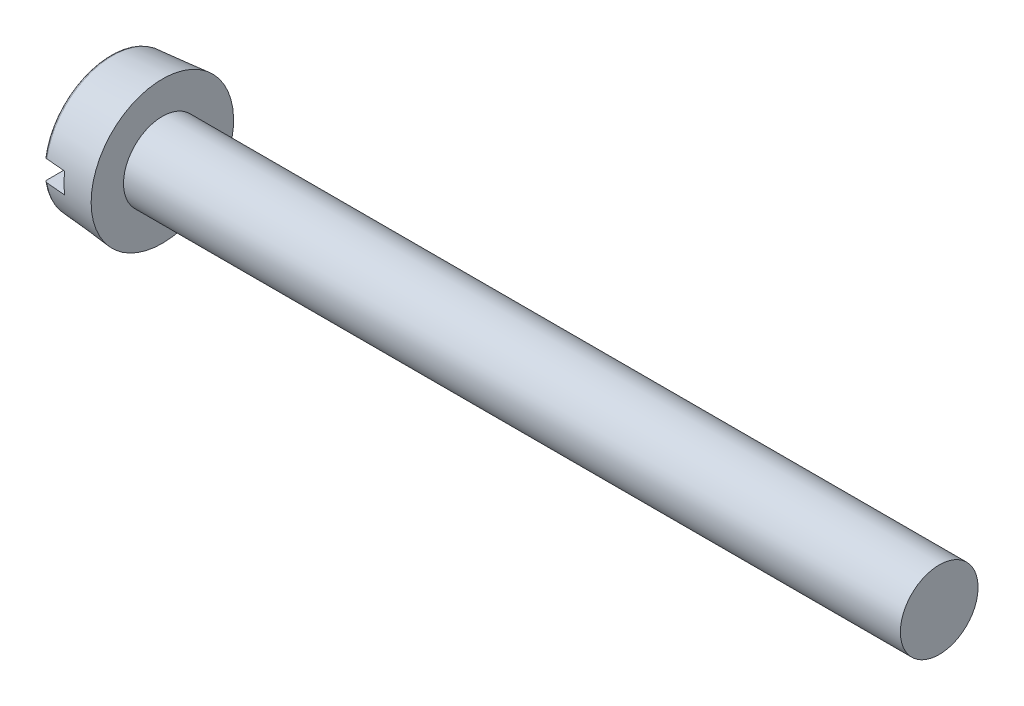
ISO-10303-21;
HEADER;
FILE_DESCRIPTION(('STEP AP214'),'2;1');
FILE_NAME('part.step','',(''),(''),'','','');
FILE_SCHEMA(('AUTOMOTIVE_DESIGN { 1 0 10303 214 1 1 1 1 }'));
ENDSEC;
DATA;
#1=APPLICATION_CONTEXT('core data for automotive mechanical design processes');
#2=APPLICATION_PROTOCOL_DEFINITION('international standard','automotive_design',2000,#1);
#3=PRODUCT_CONTEXT('',#1,'mechanical');
#4=PRODUCT('Part','Part','',(#3));
#5=PRODUCT_RELATED_PRODUCT_CATEGORY('part','',(#4));
#6=PRODUCT_DEFINITION_FORMATION('','',#4);
#7=PRODUCT_DEFINITION_CONTEXT('part definition',#1,'design');
#8=PRODUCT_DEFINITION('design','',#6,#7);
#9=PRODUCT_DEFINITION_SHAPE('','',#8);
#10=(LENGTH_UNIT() NAMED_UNIT(*) SI_UNIT(.MILLI.,.METRE.));
#11=(NAMED_UNIT(*) PLANE_ANGLE_UNIT() SI_UNIT($,.RADIAN.));
#12=(NAMED_UNIT(*) SI_UNIT($,.STERADIAN.) SOLID_ANGLE_UNIT());
#13=UNCERTAINTY_MEASURE_WITH_UNIT(LENGTH_MEASURE(1.E-05),#10,'distance_accuracy_value','');
#14=(GEOMETRIC_REPRESENTATION_CONTEXT(3) GLOBAL_UNCERTAINTY_ASSIGNED_CONTEXT((#13)) GLOBAL_UNIT_ASSIGNED_CONTEXT((#10,
#11,#12)) REPRESENTATION_CONTEXT('',''));
#15=CARTESIAN_POINT('',(0.,0.,0.));
#16=DIRECTION('',(0.,0.,1.));
#17=DIRECTION('',(1.,0.,0.));
#18=AXIS2_PLACEMENT_3D('',#15,#16,#17);
#19=CARTESIAN_POINT('',(0.,0.,0.));
#20=DIRECTION('',(-1.,0.,0.));
#21=DIRECTION('',(0.,0.,1.));
#22=AXIS2_PLACEMENT_3D('',#19,#20,#21);
#23=PLANE('',#22);
#24=DIRECTION('',(0.,0.,-1.));
#25=VECTOR('',#24,1.);
#26=CARTESIAN_POINT('',(0.,0.4,2.75));
#27=LINE('',#26,#25);
#28=CARTESIAN_POINT('',(0.,0.4,2.45096382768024));
#29=VERTEX_POINT('',#28);
#30=CARTESIAN_POINT('',(0.,0.4,-2.45096382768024));
#31=VERTEX_POINT('',#30);
#32=EDGE_CURVE('E104',#29,#31,#27,.T.);
#33=ORIENTED_EDGE('',*,*,#32,.F.);
#34=CARTESIAN_POINT('',(0.,0.,0.));
#35=DIRECTION('',(-1.,0.,0.));
#36=DIRECTION('',(0.,0.,1.));
#37=AXIS2_PLACEMENT_3D('',#34,#35,#36);
#38=CIRCLE('',#37,2.48338955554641);
#39=EDGE_CURVE('E106',#29,#31,#38,.T.);
#40=ORIENTED_EDGE('',*,*,#39,.T.);
#41=EDGE_LOOP('',(#33,#40));
#42=FACE_BOUND('',#41,.T.);
#43=ADVANCED_FACE('F35',(#42),#23,.T.);
#44=CARTESIAN_POINT('',(0.1,0.,0.));
#45=DIRECTION('',(-1.,0.,0.));
#46=DIRECTION('',(0.,0.,1.));
#47=AXIS2_PLACEMENT_3D('',#44,#45,#46);
#48=TOROIDAL_SURFACE('',#47,2.48338955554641,0.1);
#49=CARTESIAN_POINT('',(0.0289938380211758,0.4,-2.52228316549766));
#50=CARTESIAN_POINT('',(0.0329146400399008,0.4,-2.52628601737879));
#51=CARTESIAN_POINT('',(0.0371732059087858,0.4,-2.52996330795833));
#52=CARTESIAN_POINT('',(0.0462494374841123,0.4,-2.53655558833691));
#53=CARTESIAN_POINT('',(0.0510676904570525,0.4,-2.53946976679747));
#54=CARTESIAN_POINT('',(0.061126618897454,0.4,-2.54444525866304));
#55=CARTESIAN_POINT('',(0.0663672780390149,0.4,-2.54650660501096));
#56=CARTESIAN_POINT('',(0.0771205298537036,0.4,-2.5497128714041));
#57=CARTESIAN_POINT('',(0.0826330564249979,0.4,-2.55085801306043));
#58=CARTESIAN_POINT('',(0.0937360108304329,0.4,-2.55219318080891));
#59=CARTESIAN_POINT('',(0.0993256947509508,0.4,-2.55238939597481));
#60=CARTESIAN_POINT('',(0.110458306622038,0.4,-2.55183747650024));
#61=CARTESIAN_POINT('',(0.116001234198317,0.4,-2.55108933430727));
#62=CARTESIAN_POINT('',(0.12686581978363,0.4,-2.54867516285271));
#63=CARTESIAN_POINT('',(0.132188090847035,0.4,-2.54701188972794));
#64=CARTESIAN_POINT('',(0.142479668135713,0.4,-2.54281935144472));
#65=CARTESIAN_POINT('',(0.147448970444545,0.4,-2.54029007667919));
#66=CARTESIAN_POINT('',(0.156919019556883,0.4,-2.53442699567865));
#67=CARTESIAN_POINT('',(0.161417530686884,0.4,-2.53108957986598));
#68=CARTESIAN_POINT('',(0.169797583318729,0.4,-2.52371398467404));
#69=CARTESIAN_POINT('',(0.173679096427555,0.4,-2.51967577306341));
#70=CARTESIAN_POINT('',(0.180758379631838,0.4,-2.51096934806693));
#71=CARTESIAN_POINT('',(0.183948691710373,0.4,-2.50629507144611));
#72=CARTESIAN_POINT('',(0.189510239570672,0.4,-2.49648236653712));
#73=CARTESIAN_POINT('',(0.191881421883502,0.4,-2.49134390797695));
#74=CARTESIAN_POINT('',(0.195767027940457,0.4,-2.480682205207));
#75=CARTESIAN_POINT('',(0.197270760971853,0.4,-2.47515506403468));
#76=CARTESIAN_POINT('',(0.199338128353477,0.4,-2.46392763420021));
#77=CARTESIAN_POINT('',(0.199901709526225,0.4,-2.45822733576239));
#78=CARTESIAN_POINT('',(0.20007548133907,0.4,-2.44676112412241));
#79=CARTESIAN_POINT('',(0.199677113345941,0.4,-2.44099507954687));
#80=CARTESIAN_POINT('',(0.197919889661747,0.4,-2.42961109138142));
#81=CARTESIAN_POINT('',(0.196561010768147,0.4,-2.42399315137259));
#82=CARTESIAN_POINT('',(0.192915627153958,0.4,-2.41305590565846));
#83=CARTESIAN_POINT('',(0.190627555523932,0.4,-2.40773712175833));
#84=CARTESIAN_POINT('',(0.185185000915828,0.4,-2.39756279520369));
#85=CARTESIAN_POINT('',(0.182030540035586,0.4,-2.39270724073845));
#86=CARTESIAN_POINT('',(0.174965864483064,0.4,-2.38363467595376));
#87=CARTESIAN_POINT('',(0.17106099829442,0.4,-2.37941350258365));
#88=CARTESIAN_POINT('',(0.162589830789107,0.4,-2.37169707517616));
#89=CARTESIAN_POINT('',(0.158023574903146,0.4,-2.36820177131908));
#90=CARTESIAN_POINT('',(0.148421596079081,0.4,-2.36208459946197));
#91=CARTESIAN_POINT('',(0.14339263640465,0.4,-2.35945211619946));
#92=CARTESIAN_POINT('',(0.132960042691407,0.4,-2.35508144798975));
#93=CARTESIAN_POINT('',(0.127556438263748,0.4,-2.35334319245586));
#94=CARTESIAN_POINT('',(0.116602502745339,0.4,-2.35083201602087));
#95=CARTESIAN_POINT('',(0.111054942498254,0.4,-2.35004699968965));
#96=CARTESIAN_POINT('',(0.0999070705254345,0.4,-2.3494263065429));
#97=CARTESIAN_POINT('',(0.0943067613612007,0.4,-2.34959058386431));
#98=CARTESIAN_POINT('',(0.0832511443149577,0.4,-2.35085902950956));
#99=CARTESIAN_POINT('',(0.0777951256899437,0.4,-2.3519570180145));
#100=CARTESIAN_POINT('',(0.0671440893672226,0.4,-2.35505088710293));
#101=CARTESIAN_POINT('',(0.0619490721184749,0.4,-2.35704676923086));
#102=CARTESIAN_POINT('',(0.0519500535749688,0.4,-2.36188301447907));
#103=CARTESIAN_POINT('',(0.0471472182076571,0.4,-2.36472578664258));
#104=CARTESIAN_POINT('',(0.0380802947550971,0.4,-2.37116917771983));
#105=CARTESIAN_POINT('',(0.0338162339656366,0.4,-2.37476983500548));
#106=CARTESIAN_POINT('',(0.025897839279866,0.4,-2.38266730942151));
#107=CARTESIAN_POINT('',(0.0222505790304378,0.4,-2.38697121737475));
#108=CARTESIAN_POINT('',(0.0157188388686,0.4,-2.39612333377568));
#109=CARTESIAN_POINT('',(0.0128344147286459,0.4,-2.40097158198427));
#110=CARTESIAN_POINT('',(0.00786953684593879,0.4,-2.41114518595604));
#111=CARTESIAN_POINT('',(0.00580049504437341,0.4,-2.41647611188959));
#112=CARTESIAN_POINT('',(0.00257668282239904,0.4,-2.4274074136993));
#113=CARTESIAN_POINT('',(0.00142193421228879,0.4,-2.4330077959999));
#114=CARTESIAN_POINT('',(4.98309082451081E-05,0.4,-2.44437919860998));
#115=CARTESIAN_POINT('',(-0.000158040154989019,0.4,-2.45015136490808));
#116=CARTESIAN_POINT('',(0.000395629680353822,0.4,-2.46165070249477));
#117=CARTESIAN_POINT('',(0.00115743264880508,0.4,-2.46737786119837));
#118=CARTESIAN_POINT('',(0.00363465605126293,0.4,-2.47863907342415));
#119=CARTESIAN_POINT('',(0.00535281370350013,0.4,-2.48417252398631));
#120=CARTESIAN_POINT('',(0.00969850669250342,0.4,-2.49486489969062));
#121=CARTESIAN_POINT('',(0.0123249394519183,0.4,-2.50002426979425));
#122=CARTESIAN_POINT('',(0.0173136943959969,0.4,-2.50805181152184));
#123=CARTESIAN_POINT('',(0.019430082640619,0.4,-2.51107561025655));
#124=CARTESIAN_POINT('',(0.0239801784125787,0.4,-2.51687431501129));
#125=CARTESIAN_POINT('',(0.0264138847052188,0.4,-2.5196492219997));
#126=CARTESIAN_POINT('',(0.0289938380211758,0.4,-2.52228316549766));
#127=B_SPLINE_CURVE_WITH_KNOTS('',3,(#49,#50,#51,#52,#53,#54,#55,#56,#57,#58,#59,#60,#61,#62,
#63,#64,#65,#66,#67,#68,#69,#70,#71,#72,#73,#74,#75,#76,#77,#78,#79,#80,#81,#82,#83,#84,#85,#86,
#87,#88,#89,#90,#91,#92,#93,#94,#95,#96,#97,#98,#99,#100,#101,#102,#103,#104,#105,#106,#107,
#108,#109,#110,#111,#112,#113,#114,#115,#116,#117,#118,#119,#120,#121,#122,#123,#124,#125,#126),
.UNSPECIFIED.,.T.,.F.,(4,2,2,2,2,2,2,2,2,2,2,2,2,2,2,2,2,2,2,2,2,2,2,2,2,2,2,2,2,2,2,2,2,2,2,2,
2,2,4),(0.,0.0167962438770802,0.0336102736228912,0.0504236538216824,0.0672329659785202,
0.0839324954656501,0.100632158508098,0.11728179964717,0.133931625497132,0.150657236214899,
0.167383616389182,0.184282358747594,0.201182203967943,0.218286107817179,0.235390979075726,
0.252648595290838,0.269906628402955,0.287193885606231,0.304480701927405,0.321648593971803,
0.338815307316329,0.355762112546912,0.372707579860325,0.389435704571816,0.406163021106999,
0.422780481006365,0.439397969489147,0.456063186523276,0.472729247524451,0.489575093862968,
0.506422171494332,0.523497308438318,0.540572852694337,0.557819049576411,0.575069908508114,
0.592370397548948,0.609649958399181,0.620702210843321,0.631754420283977),.UNSPECIFIED.);
#128=CARTESIAN_POINT('',(0.0912844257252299,0.4,-2.5518494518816));
#129=VERTEX_POINT('',#128);
#130=EDGE_CURVE('E59',#31,#129,#127,.T.);
#131=ORIENTED_EDGE('',*,*,#130,.F.);
#132=ORIENTED_EDGE('',*,*,#39,.F.);
#133=CARTESIAN_POINT('',(0.0367676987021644,0.4,2.37243473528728));
#134=CARTESIAN_POINT('',(0.0410691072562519,0.4,2.36887462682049));
#135=CARTESIAN_POINT('',(0.0456712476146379,0.4,2.36567202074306));
#136=CARTESIAN_POINT('',(0.0553504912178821,0.4,2.36008032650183));
#137=CARTESIAN_POINT('',(0.0604280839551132,0.4,2.35769208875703));
#138=CARTESIAN_POINT('',(0.0709135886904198,0.4,2.35380489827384));
#139=CARTESIAN_POINT('',(0.076321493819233,0.4,2.35230592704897));
#140=CARTESIAN_POINT('',(0.0873116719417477,0.4,2.35024450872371));
#141=CARTESIAN_POINT('',(0.0928939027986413,0.4,2.34968183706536));
#142=CARTESIAN_POINT('',(0.104036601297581,0.4,2.34951039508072));
#143=CARTESIAN_POINT('',(0.109596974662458,0.4,2.34989545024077));
#144=CARTESIAN_POINT('',(0.120573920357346,0.4,2.35159460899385));
#145=CARTESIAN_POINT('',(0.125990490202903,0.4,2.35290872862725));
#146=CARTESIAN_POINT('',(0.13652239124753,0.4,2.35642416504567));
#147=CARTESIAN_POINT('',(0.141637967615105,0.4,2.35862474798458));
#148=CARTESIAN_POINT('',(0.151431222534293,0.4,2.36384674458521));
#149=CARTESIAN_POINT('',(0.156108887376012,0.4,2.36686818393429));
#150=CARTESIAN_POINT('',(0.164936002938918,0.4,2.37367095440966));
#151=CARTESIAN_POINT('',(0.16908079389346,0.4,2.3774583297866));
#152=CARTESIAN_POINT('',(0.176685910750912,0.4,2.38566704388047));
#153=CARTESIAN_POINT('',(0.180146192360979,0.4,2.39008842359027));
#154=CARTESIAN_POINT('',(0.186332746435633,0.4,2.39950205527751));
#155=CARTESIAN_POINT('',(0.189048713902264,0.4,2.40450107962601));
#156=CARTESIAN_POINT('',(0.193614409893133,0.4,2.41488017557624));
#157=CARTESIAN_POINT('',(0.195464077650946,0.4,2.42026027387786));
#158=CARTESIAN_POINT('',(0.198266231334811,0.4,2.43131856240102));
#159=CARTESIAN_POINT('',(0.199207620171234,0.4,2.43699956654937));
#160=CARTESIAN_POINT('',(0.20012925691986,0.4,2.4484391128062));
#161=CARTESIAN_POINT('',(0.200109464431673,0.4,2.45419765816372));
#162=CARTESIAN_POINT('',(0.199105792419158,0.4,2.46566309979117));
#163=CARTESIAN_POINT('',(0.198116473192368,0.4,2.47136952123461));
#164=CARTESIAN_POINT('',(0.195191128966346,0.4,2.48253449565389));
#165=CARTESIAN_POINT('',(0.193255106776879,0.4,2.48799304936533));
#166=CARTESIAN_POINT('',(0.188494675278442,0.4,2.49848893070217));
#167=CARTESIAN_POINT('',(0.185672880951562,0.4,2.50352744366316));
#168=CARTESIAN_POINT('',(0.17921549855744,0.4,2.51305299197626));
#169=CARTESIAN_POINT('',(0.175579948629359,0.4,2.51754005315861));
#170=CARTESIAN_POINT('',(0.167635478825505,0.4,2.52578731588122));
#171=CARTESIAN_POINT('',(0.163333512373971,0.4,2.5295542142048));
#172=CARTESIAN_POINT('',(0.15415155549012,0.4,2.53630156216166));
#173=CARTESIAN_POINT('',(0.149271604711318,0.4,2.53928206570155));
#174=CARTESIAN_POINT('',(0.13913635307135,0.4,2.54433379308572));
#175=CARTESIAN_POINT('',(0.133886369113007,0.4,2.54641568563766));
#176=CARTESIAN_POINT('',(0.123109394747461,0.4,2.54965893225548));
#177=CARTESIAN_POINT('',(0.117582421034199,0.4,2.55082034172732));
#178=CARTESIAN_POINT('',(0.106464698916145,0.4,2.55218028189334));
#179=CARTESIAN_POINT('',(0.100875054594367,0.4,2.55238785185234));
#180=CARTESIAN_POINT('',(0.0897407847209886,0.4,2.55185843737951));
#181=CARTESIAN_POINT('',(0.0841961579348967,0.4,2.55112147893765));
#182=CARTESIAN_POINT('',(0.0733265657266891,0.4,2.54872918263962));
#183=CARTESIAN_POINT('',(0.0680009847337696,0.4,2.54707663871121));
#184=CARTESIAN_POINT('',(0.0577010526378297,0.4,2.54290481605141));
#185=CARTESIAN_POINT('',(0.0527267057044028,0.4,2.54038552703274));
#186=CARTESIAN_POINT('',(0.0432451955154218,0.4,2.53454156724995));
#187=CARTESIAN_POINT('',(0.038740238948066,0.4,2.53121331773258));
#188=CARTESIAN_POINT('',(0.0303458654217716,0.4,2.52385482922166));
#189=CARTESIAN_POINT('',(0.0264564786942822,0.4,2.51982455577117));
#190=CARTESIAN_POINT('',(0.0193602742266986,0.4,2.51113277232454));
#191=CARTESIAN_POINT('',(0.0161608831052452,0.4,2.50646520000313));
#192=CARTESIAN_POINT('',(0.0105801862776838,0.4,2.49666430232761));
#193=CARTESIAN_POINT('',(0.0081989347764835,0.4,2.491530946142));
#194=CARTESIAN_POINT('',(0.00429230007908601,0.4,2.4808776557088));
#195=CARTESIAN_POINT('',(0.00277761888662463,0.4,2.47535379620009));
#196=CARTESIAN_POINT('',(0.000687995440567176,0.4,2.46413127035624));
#197=CARTESIAN_POINT('',(0.000113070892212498,0.4,2.45843260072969));
#198=CARTESIAN_POINT('',(-8.37002456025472E-05,0.4,2.44696818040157));
#199=CARTESIAN_POINT('',(0.000302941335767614,0.4,2.44120228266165));
#200=CARTESIAN_POINT('',(0.00203701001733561,0.4,2.42981508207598));
#201=CARTESIAN_POINT('',(0.00338469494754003,0.4,2.42419381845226));
#202=CARTESIAN_POINT('',(0.00700896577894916,0.4,2.41324562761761));
#203=CARTESIAN_POINT('',(0.00928760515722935,0.4,2.40791938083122));
#204=CARTESIAN_POINT('',(0.0147114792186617,0.4,2.39773348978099));
#205=CARTESIAN_POINT('',(0.0178556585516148,0.4,2.39287328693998));
#206=CARTESIAN_POINT('',(0.0236503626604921,0.4,2.38539954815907));
#207=CARTESIAN_POINT('',(0.0260726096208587,0.4,2.38260604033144));
#208=CARTESIAN_POINT('',(0.0312086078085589,0.4,2.37730112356));
#209=CARTESIAN_POINT('',(0.0339223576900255,0.4,2.37478971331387));
#210=CARTESIAN_POINT('',(0.0367676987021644,0.4,2.37243473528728));
#211=B_SPLINE_CURVE_WITH_KNOTS('',3,(#133,#134,#135,#136,#137,#138,#139,#140,#141,#142,#143,
#144,#145,#146,#147,#148,#149,#150,#151,#152,#153,#154,#155,#156,#157,#158,#159,#160,#161,#162,
#163,#164,#165,#166,#167,#168,#169,#170,#171,#172,#173,#174,#175,#176,#177,#178,#179,#180,#181,
#182,#183,#184,#185,#186,#187,#188,#189,#190,#191,#192,#193,#194,#195,#196,#197,#198,#199,#200,
#201,#202,#203,#204,#205,#206,#207,#208,#209,#210),.UNSPECIFIED.,.T.,.F.,(4,2,2,2,2,2,2,2,2,2,2,
2,2,2,2,2,2,2,2,2,2,2,2,2,2,2,2,2,2,2,2,2,2,2,2,2,2,2,4),(0.,0.0167374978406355,
0.0334924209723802,0.0502469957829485,0.0669975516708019,0.0836392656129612,0.100281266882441,
0.116909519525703,0.133538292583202,0.150303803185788,0.167070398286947,0.18405857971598,
0.201047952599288,0.218242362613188,0.235437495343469,0.252729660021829,0.270021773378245,
0.287263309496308,0.304504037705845,0.321575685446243,0.338646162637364,0.35550798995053,
0.372368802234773,0.389069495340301,0.405769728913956,0.422419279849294,0.439069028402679,
0.455793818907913,0.472519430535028,0.489416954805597,0.506315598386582,0.523418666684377,
0.540522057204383,0.557776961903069,0.57503649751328,0.592334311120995,0.609611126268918,
0.620682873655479,0.631754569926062),.UNSPECIFIED.);
#212=CARTESIAN_POINT('',(0.0912844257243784,0.4,2.55184945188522));
#213=VERTEX_POINT('',#212);
#214=EDGE_CURVE('E96',#213,#29,#211,.T.);
#215=ORIENTED_EDGE('',*,*,#214,.F.);
#216=CARTESIAN_POINT('',(0.0912844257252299,0.,0.));
#217=DIRECTION('',(-1.,0.,0.));
#218=DIRECTION('',(0.,0.,1.));
#219=AXIS2_PLACEMENT_3D('',#216,#217,#218);
#220=CIRCLE('',#219,2.58300902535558);
#221=EDGE_CURVE('E110',#129,#213,#220,.F.);
#222=ORIENTED_EDGE('',*,*,#221,.F.);
#223=EDGE_LOOP('',(#131,#132,#215,#222));
#224=FACE_BOUND('',#223,.T.);
#225=ADVANCED_FACE('F187',(#224),#48,.T.);
#226=CARTESIAN_POINT('',(-25.4,0.,0.));
#227=DIRECTION('',(-1.,0.,0.));
#228=DIRECTION('',(0.,0.,1.));
#229=AXIS2_PLACEMENT_3D('',#226,#227,#228);
#230=CYLINDRICAL_SURFACE('',#229,1.5);
#231=CARTESIAN_POINT('',(32.,0.,0.));
#232=DIRECTION('',(-1.,0.,0.));
#233=DIRECTION('',(0.,0.,1.));
#234=AXIS2_PLACEMENT_3D('',#231,#232,#233);
#235=CIRCLE('',#234,1.5);
#236=CARTESIAN_POINT('',(32.,0.,1.5));
#237=VERTEX_POINT('',#236);
#238=EDGE_CURVE('E107',#237,#237,#235,.T.);
#239=ORIENTED_EDGE('',*,*,#238,.T.);
#240=EDGE_LOOP('',(#239));
#241=FACE_BOUND('',#240,.T.);
#242=CARTESIAN_POINT('',(2.,0.,0.));
#243=DIRECTION('',(-1.,0.,0.));
#244=DIRECTION('',(0.,0.,1.));
#245=AXIS2_PLACEMENT_3D('',#242,#243,#244);
#246=CIRCLE('',#245,1.5);
#247=CARTESIAN_POINT('',(2.,0.,1.5));
#248=VERTEX_POINT('',#247);
#249=EDGE_CURVE('E174',#248,#248,#246,.T.);
#250=ORIENTED_EDGE('',*,*,#249,.F.);
#251=EDGE_LOOP('',(#250));
#252=FACE_BOUND('',#251,.T.);
#253=ADVANCED_FACE('F184',(#241,#252),#230,.T.);
#254=CARTESIAN_POINT('',(32.,1.5,0.));
#255=DIRECTION('',(1.,0.,0.));
#256=DIRECTION('',(0.,0.,-1.));
#257=AXIS2_PLACEMENT_3D('',#254,#255,#256);
#258=PLANE('',#257);
#259=ORIENTED_EDGE('',*,*,#238,.F.);
#260=EDGE_LOOP('',(#259));
#261=FACE_BOUND('',#260,.T.);
#262=ADVANCED_FACE('F186',(#261),#258,.T.);
#263=DIRECTION('',(0.,0.,1.));
#264=VECTOR('',#263,1.);
#265=CARTESIAN_POINT('',(0.,-0.4,-2.75));
#266=LINE('',#265,#264);
#267=CARTESIAN_POINT('',(0.,-0.4,-2.45096382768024));
#268=VERTEX_POINT('',#267);
#269=CARTESIAN_POINT('',(0.,-0.4,2.45096382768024));
#270=VERTEX_POINT('',#269);
#271=EDGE_CURVE('E51',#268,#270,#266,.T.);
#272=ORIENTED_EDGE('',*,*,#271,.F.);
#273=EDGE_CURVE('E102',#268,#270,#38,.T.);
#274=ORIENTED_EDGE('',*,*,#273,.T.);
#275=EDGE_LOOP('',(#272,#274));
#276=FACE_BOUND('',#275,.T.);
#277=ADVANCED_FACE('F101',(#276),#23,.T.);
#278=CARTESIAN_POINT('',(0.,0.,0.));
#279=DIRECTION('',(1.,0.,0.));
#280=DIRECTION('',(0.,0.,-1.));
#281=AXIS2_PLACEMENT_3D('',#278,#279,#280);
#282=CONICAL_SURFACE('',#281,2.57502267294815,0.0872664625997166);
#283=CARTESIAN_POINT('',(-4.36225986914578,0.4,-2.15659249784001));
#284=CARTESIAN_POINT('',(-3.0225287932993,0.4,-2.27578971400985));
#285=CARTESIAN_POINT('',(-1.68277158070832,0.4,-2.3946924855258));
#286=CARTESIAN_POINT('',(-0.0871929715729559,0.4,-2.53604555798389));
#287=CARTESIAN_POINT('',(0.168610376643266,0.4,-2.55869953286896));
#288=CARTESIAN_POINT('',(2.02000114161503,0.4,-2.72260692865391));
#289=CARTESIAN_POINT('',(3.61561248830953,0.4,-2.86359016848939));
#290=CARTESIAN_POINT('',(5.21123588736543,0.4,-3.00443640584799));
#291=B_SPLINE_CURVE_WITH_KNOTS('',3,(#283,#284,#285,#286,#287,#288,#289,#290),.UNSPECIFIED.,.F.,
.F.,(4,2,2,4),(0.,4.03506939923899,4.80548292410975,9.61096578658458),.UNSPECIFIED.);
#292=CARTESIAN_POINT('',(0.85,0.4,-2.61901832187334));
#293=VERTEX_POINT('',#292);
#294=EDGE_CURVE('E168',#129,#293,#291,.T.);
#295=ORIENTED_EDGE('',*,*,#294,.F.);
#296=ORIENTED_EDGE('',*,*,#221,.T.);
#297=CARTESIAN_POINT('',(5.21123588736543,0.4,3.00443640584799));
#298=CARTESIAN_POINT('',(4.41342358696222,0.4,2.93401988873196));
#299=CARTESIAN_POINT('',(3.61561486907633,0.4,2.86356274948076));
#300=CARTESIAN_POINT('',(2.02000692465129,0.4,2.72254136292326));
#301=CARTESIAN_POINT('',(1.22220769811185,0.4,2.65197711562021));
#302=CARTESIAN_POINT('',(-0.373378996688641,0.4,2.51071564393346));
#303=CARTESIAN_POINT('',(-1.17116646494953,0.4,2.44001841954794));
#304=CARTESIAN_POINT('',(-2.76672581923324,0.4,2.298448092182));
#305=CARTESIAN_POINT('',(-3.56449770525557,0.4,2.22757498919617));
#306=CARTESIAN_POINT('',(-4.36225986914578,0.4,2.15659249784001));
#307=B_SPLINE_CURVE_WITH_KNOTS('',3,(#297,#298,#299,#300,#301,#302,#303,#304,#305,#306),
.UNSPECIFIED.,.F.,.F.,(4,2,2,2,4),(0.,2.40274147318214,4.80548287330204,7.20822430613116,
9.6109658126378),.UNSPECIFIED.);
#308=CARTESIAN_POINT('',(0.85,0.4,2.61901832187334));
#309=VERTEX_POINT('',#308);
#310=EDGE_CURVE('E163',#309,#213,#307,.T.);
#311=ORIENTED_EDGE('',*,*,#310,.F.);
#312=CARTESIAN_POINT('',(0.85,0.,0.));
#313=DIRECTION('',(-1.,0.,0.));
#314=DIRECTION('',(0.,0.,1.));
#315=AXIS2_PLACEMENT_3D('',#312,#313,#314);
#316=CIRCLE('',#315,2.64938803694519);
#317=CARTESIAN_POINT('',(0.85,-0.4,2.61901832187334));
#318=VERTEX_POINT('',#317);
#319=EDGE_CURVE('E40',#309,#318,#316,.F.);
#320=ORIENTED_EDGE('',*,*,#319,.T.);
#321=CARTESIAN_POINT('',(-4.36225986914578,-0.4,2.15659249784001));
#322=CARTESIAN_POINT('',(-3.0225287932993,-0.4,2.27578971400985));
#323=CARTESIAN_POINT('',(-1.68277158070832,-0.4,2.3946924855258));
#324=CARTESIAN_POINT('',(-0.0871929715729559,-0.4,2.53604555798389));
#325=CARTESIAN_POINT('',(0.168610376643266,-0.4,2.55869953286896));
#326=CARTESIAN_POINT('',(2.02000114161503,-0.4,2.72260692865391));
#327=CARTESIAN_POINT('',(3.61561248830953,-0.400000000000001,2.86359016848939));
#328=CARTESIAN_POINT('',(5.21123588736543,-0.4,3.00443640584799));
#329=B_SPLINE_CURVE_WITH_KNOTS('',3,(#321,#322,#323,#324,#325,#326,#327,#328),.UNSPECIFIED.,.F.,
.F.,(4,2,2,4),(0.,4.03506939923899,4.80548292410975,9.61096578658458),.UNSPECIFIED.);
#330=CARTESIAN_POINT('',(0.0912844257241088,-0.4,2.55184945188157));
#331=VERTEX_POINT('',#330);
#332=EDGE_CURVE('E139',#331,#318,#329,.T.);
#333=ORIENTED_EDGE('',*,*,#332,.F.);
#334=CARTESIAN_POINT('',(0.0912844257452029,-0.4,-2.55184945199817));
#335=VERTEX_POINT('',#334);
#336=EDGE_CURVE('E116',#331,#335,#220,.F.);
#337=ORIENTED_EDGE('',*,*,#336,.T.);
#338=CARTESIAN_POINT('',(5.21123588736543,-0.4,-3.00443640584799));
#339=CARTESIAN_POINT('',(4.41342358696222,-0.4,-2.93401988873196));
#340=CARTESIAN_POINT('',(3.61561486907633,-0.4,-2.86356274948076));
#341=CARTESIAN_POINT('',(2.02000692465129,-0.4,-2.72254136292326));
#342=CARTESIAN_POINT('',(1.22220769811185,-0.4,-2.65197711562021));
#343=CARTESIAN_POINT('',(-0.373378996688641,-0.4,-2.51071564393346));
#344=CARTESIAN_POINT('',(-1.17116646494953,-0.4,-2.44001841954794));
#345=CARTESIAN_POINT('',(-2.76672581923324,-0.4,-2.298448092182));
#346=CARTESIAN_POINT('',(-3.56449770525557,-0.4,-2.22757498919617));
#347=CARTESIAN_POINT('',(-4.36225986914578,-0.4,-2.15659249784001));
#348=B_SPLINE_CURVE_WITH_KNOTS('',3,(#338,#339,#340,#341,#342,#343,#344,#345,#346,#347),
.UNSPECIFIED.,.F.,.F.,(4,2,2,2,4),(0.,2.40274147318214,4.80548287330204,7.20822430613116,
9.6109658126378),.UNSPECIFIED.);
#349=CARTESIAN_POINT('',(0.85,-0.4,-2.61901832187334));
#350=VERTEX_POINT('',#349);
#351=EDGE_CURVE('E91',#350,#335,#348,.T.);
#352=ORIENTED_EDGE('',*,*,#351,.F.);
#353=EDGE_CURVE('E11',#350,#293,#316,.F.);
#354=ORIENTED_EDGE('',*,*,#353,.T.);
#355=EDGE_LOOP('',(#295,#296,#311,#320,#333,#337,#352,#354));
#356=FACE_BOUND('',#355,.T.);
#357=CARTESIAN_POINT('',(2.,0.,0.));
#358=DIRECTION('',(-1.,0.,0.));
#359=DIRECTION('',(0.,0.,1.));
#360=AXIS2_PLACEMENT_3D('',#357,#358,#359);
#361=CIRCLE('',#360,2.75);
#362=CARTESIAN_POINT('',(2.,0.,2.75));
#363=VERTEX_POINT('',#362);
#364=EDGE_CURVE('E112',#363,#363,#361,.T.);
#365=ORIENTED_EDGE('',*,*,#364,.T.);
#366=EDGE_LOOP('',(#365));
#367=FACE_BOUND('',#366,.T.);
#368=ADVANCED_FACE('F152',(#356,#367),#282,.T.);
#369=CARTESIAN_POINT('',(2.,1.5,0.));
#370=DIRECTION('',(-1.,0.,0.));
#371=DIRECTION('',(0.,0.,1.));
#372=AXIS2_PLACEMENT_3D('',#369,#370,#371);
#373=PLANE('',#372);
#374=ORIENTED_EDGE('',*,*,#364,.F.);
#375=EDGE_LOOP('',(#374));
#376=FACE_BOUND('',#375,.T.);
#377=ORIENTED_EDGE('',*,*,#249,.T.);
#378=EDGE_LOOP('',(#377));
#379=FACE_BOUND('',#378,.T.);
#380=ADVANCED_FACE('F156',(#376,#379),#373,.F.);
#381=CARTESIAN_POINT('',(0.0289938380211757,-0.4,-2.52228316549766));
#382=CARTESIAN_POINT('',(0.0250040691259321,-0.4,-2.51820918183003));
#383=CARTESIAN_POINT('',(0.0213583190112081,-0.4,-2.51379201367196));
#384=CARTESIAN_POINT('',(0.0148592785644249,-0.4,-2.50440306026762));
#385=CARTESIAN_POINT('',(0.0120070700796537,-0.4,-2.49943053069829));
#386=CARTESIAN_POINT('',(0.00717770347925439,-0.4,-2.48908271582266));
#387=CARTESIAN_POINT('',(0.00519971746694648,-0.4,-2.48370781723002));
#388=CARTESIAN_POINT('',(0.00216717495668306,-0.4,-2.47270542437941));
#389=CARTESIAN_POINT('',(0.00111238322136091,-0.4,-2.4670779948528));
#390=CARTESIAN_POINT('',(-5.25582059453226E-05,-0.4,-2.45568286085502));
#391=CARTESIAN_POINT('',(-0.000155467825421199,-0.4,-2.44991441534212));
#392=CARTESIAN_POINT('',(0.000604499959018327,-0.4,-2.43844109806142));
#393=CARTESIAN_POINT('',(0.00146745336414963,-0.4,-2.43273623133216));
#394=CARTESIAN_POINT('',(0.00414151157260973,-0.4,-2.42152987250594));
#395=CARTESIAN_POINT('',(0.00595623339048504,-0.4,-2.41602924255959));
#396=CARTESIAN_POINT('',(0.0104876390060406,-0.4,-2.40541275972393));
#397=CARTESIAN_POINT('',(0.0132043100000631,-0.4,-2.40029690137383));
#398=CARTESIAN_POINT('',(0.0194512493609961,-0.4,-2.39062289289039));
#399=CARTESIAN_POINT('',(0.0229775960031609,-0.4,-2.38606221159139));
#400=CARTESIAN_POINT('',(0.0307542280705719,-0.4,-2.37760643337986));
#401=CARTESIAN_POINT('',(0.0350044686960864,-0.4,-2.37371129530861));
#402=CARTESIAN_POINT('',(0.0440555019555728,-0.4,-2.3667470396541));
#403=CARTESIAN_POINT('',(0.0488492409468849,-0.4,-2.36366875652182));
#404=CARTESIAN_POINT('',(0.0588909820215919,-0.4,-2.3583735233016));
#405=CARTESIAN_POINT('',(0.0641389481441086,-0.4,-2.35615650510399));
#406=CARTESIAN_POINT('',(0.0748640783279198,-0.4,-2.35267719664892));
#407=CARTESIAN_POINT('',(0.0803372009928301,-0.4,-2.35140244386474));
#408=CARTESIAN_POINT('',(0.0914202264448,-0.4,-2.34979886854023));
#409=CARTESIAN_POINT('',(0.0970301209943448,-0.4,-2.34946998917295));
#410=CARTESIAN_POINT('',(0.108175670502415,-0.4,-2.34976708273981));
#411=CARTESIAN_POINT('',(0.113711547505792,-0.4,-2.35038480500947));
#412=CARTESIAN_POINT('',(0.124600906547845,-0.4,-2.35254069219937));
#413=CARTESIAN_POINT('',(0.129954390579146,-0.4,-2.35407884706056));
#414=CARTESIAN_POINT('',(0.140330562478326,-0.4,-2.35802931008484));
#415=CARTESIAN_POINT('',(0.145353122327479,-0.4,-2.36044195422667));
#416=CARTESIAN_POINT('',(0.1549268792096,-0.4,-2.36606888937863));
#417=CARTESIAN_POINT('',(0.159478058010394,-0.4,-2.36928321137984));
#418=CARTESIAN_POINT('',(0.168025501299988,-0.4,-2.37645214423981));
#419=CARTESIAN_POINT('',(0.172016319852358,-0.4,-2.38041324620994));
#420=CARTESIAN_POINT('',(0.179287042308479,-0.4,-2.3889414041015));
#421=CARTESIAN_POINT('',(0.182566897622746,-0.4,-2.3935085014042));
#422=CARTESIAN_POINT('',(0.188369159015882,-0.4,-2.40318459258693));
#423=CARTESIAN_POINT('',(0.190880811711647,-0.4,-2.40830003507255));
#424=CARTESIAN_POINT('',(0.195020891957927,-0.4,-2.41887665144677));
#425=CARTESIAN_POINT('',(0.196649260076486,-0.4,-2.42433784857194));
#426=CARTESIAN_POINT('',(0.198994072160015,-0.4,-2.43551846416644));
#427=CARTESIAN_POINT('',(0.199699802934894,-0.4,-2.4412401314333));
#428=CARTESIAN_POINT('',(0.200145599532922,-0.4,-2.45272108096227));
#429=CARTESIAN_POINT('',(0.199885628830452,-0.4,-2.45848036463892));
#430=CARTESIAN_POINT('',(0.19840271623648,-0.4,-2.46990089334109));
#431=CARTESIAN_POINT('',(0.197175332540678,-0.4,-2.47556156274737));
#432=CARTESIAN_POINT('',(0.193783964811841,-0.4,-2.48659519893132));
#433=CARTESIAN_POINT('',(0.191619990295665,-0.4,-2.49196816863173));
#434=CARTESIAN_POINT('',(0.186423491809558,-0.4,-2.5022498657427));
#435=CARTESIAN_POINT('',(0.183394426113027,-0.4,-2.50716034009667));
#436=CARTESIAN_POINT('',(0.17654674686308,-0.4,-2.51639609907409));
#437=CARTESIAN_POINT('',(0.17272817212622,-0.4,-2.52072141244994));
#438=CARTESIAN_POINT('',(0.164451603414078,-0.4,-2.52861521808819));
#439=CARTESIAN_POINT('',(0.160000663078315,-0.4,-2.53219110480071));
#440=CARTESIAN_POINT('',(0.150555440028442,-0.4,-2.53853392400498));
#441=CARTESIAN_POINT('',(0.145561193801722,-0.4,-2.54130091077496));
#442=CARTESIAN_POINT('',(0.1352363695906,-0.4,-2.54591243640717));
#443=CARTESIAN_POINT('',(0.129910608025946,-0.4,-2.54776776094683));
#444=CARTESIAN_POINT('',(0.119021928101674,-0.4,-2.55054885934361));
#445=CARTESIAN_POINT('',(0.113459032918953,-0.4,-2.55147472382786));
#446=CARTESIAN_POINT('',(0.102307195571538,-0.4,-2.55236453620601));
#447=CARTESIAN_POINT('',(0.0967189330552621,-0.4,-2.55233702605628));
#448=CARTESIAN_POINT('',(0.0856253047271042,-0.4,-2.55134185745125));
#449=CARTESIAN_POINT('',(0.0801199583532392,-0.4,-2.55037398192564));
#450=CARTESIAN_POINT('',(0.0693593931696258,-0.4,-2.5475299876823));
#451=CARTESIAN_POINT('',(0.0641037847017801,-0.4,-2.54565533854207));
#452=CARTESIAN_POINT('',(0.0539843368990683,-0.4,-2.54105571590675));
#453=CARTESIAN_POINT('',(0.0491200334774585,-0.4,-2.53833176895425));
#454=CARTESIAN_POINT('',(0.0417210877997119,-0.4,-2.53333714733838));
#455=CARTESIAN_POINT('',(0.0390206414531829,-0.4,-2.53130731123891));
#456=CARTESIAN_POINT('',(0.0338378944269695,-0.4,-2.5269861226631));
#457=CARTESIAN_POINT('',(0.0313555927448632,-0.4,-2.5246947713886));
#458=CARTESIAN_POINT('',(0.0289938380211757,-0.4,-2.52228316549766));
#459=B_SPLINE_CURVE_WITH_KNOTS('',3,(#381,#382,#383,#384,#385,#386,#387,#388,#389,#390,#391,
#392,#393,#394,#395,#396,#397,#398,#399,#400,#401,#402,#403,#404,#405,#406,#407,#408,#409,#410,
#411,#412,#413,#414,#415,#416,#417,#418,#419,#420,#421,#422,#423,#424,#425,#426,#427,#428,#429,
#430,#431,#432,#433,#434,#435,#436,#437,#438,#439,#440,#441,#442,#443,#444,#445,#446,#447,#448,
#449,#450,#451,#452,#453,#454,#455,#456,#457,#458),.UNSPECIFIED.,.T.,.F.,(4,2,2,2,2,2,2,2,2,2,2,
2,2,2,2,2,2,2,2,2,2,2,2,2,2,2,2,2,2,2,2,2,2,2,2,2,2,2,4),(0.,0.0170942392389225,
0.0342116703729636,0.0513128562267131,0.0684096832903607,0.0856364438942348,0.102864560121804,
0.120158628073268,0.137452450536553,0.154664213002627,0.171874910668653,0.18888343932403,
0.20589062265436,0.222668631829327,0.239445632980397,0.256077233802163,0.27270865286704,
0.289346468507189,0.305984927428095,0.322775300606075,0.339566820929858,0.356583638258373,
0.37360160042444,0.390815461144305,0.408029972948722,0.425323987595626,0.442617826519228,
0.459843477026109,0.477068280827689,0.494114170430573,0.511158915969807,0.527996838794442,
0.544833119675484,0.561518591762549,0.578207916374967,0.594870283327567,0.611512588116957,
0.621631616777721,0.631750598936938),.UNSPECIFIED.);
#460=EDGE_CURVE('E87',#335,#268,#459,.T.);
#461=ORIENTED_EDGE('',*,*,#460,.F.);
#462=ORIENTED_EDGE('',*,*,#336,.F.);
#463=CARTESIAN_POINT('',(0.0367676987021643,-0.4,2.37243473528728));
#464=CARTESIAN_POINT('',(0.0323825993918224,-0.4,2.376064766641));
#465=CARTESIAN_POINT('',(0.0283037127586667,-0.4,2.38007177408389));
#466=CARTESIAN_POINT('',(0.0208754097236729,-0.4,2.38871904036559));
#467=CARTESIAN_POINT('',(0.0175270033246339,-0.4,2.3933601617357));
#468=CARTESIAN_POINT('',(0.0116570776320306,-0.4,2.40313270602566));
#469=CARTESIAN_POINT('',(0.00913472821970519,-0.4,2.40826362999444));
#470=CARTESIAN_POINT('',(0.00497968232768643,-0.4,2.41887190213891));
#471=CARTESIAN_POINT('',(0.00334675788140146,-0.4,2.42434916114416));
#472=CARTESIAN_POINT('',(0.00100169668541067,-0.4,2.43554641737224));
#473=CARTESIAN_POINT('',(0.000297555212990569,-0.4,2.44126809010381));
#474=CARTESIAN_POINT('',(-0.000145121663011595,-0.4,2.45274905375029));
#475=CARTESIAN_POINT('',(0.000116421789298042,-0.4,2.45850834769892));
#476=CARTESIAN_POINT('',(0.00160247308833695,-0.4,2.46992855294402));
#477=CARTESIAN_POINT('',(0.00283141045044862,-0.4,2.47558888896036));
#478=CARTESIAN_POINT('',(0.00622581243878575,-0.4,2.486621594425));
#479=CARTESIAN_POINT('',(0.00839126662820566,-0.4,2.49199396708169));
#480=CARTESIAN_POINT('',(0.0135905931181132,-0.4,2.50227420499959));
#481=CARTESIAN_POINT('',(0.0166210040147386,-0.4,2.50718381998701));
#482=CARTESIAN_POINT('',(0.0234711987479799,-0.4,2.51641762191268));
#483=CARTESIAN_POINT('',(0.0272909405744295,-0.4,2.52074183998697));
#484=CARTESIAN_POINT('',(0.035569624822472,-0.4,2.52863327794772));
#485=CARTESIAN_POINT('',(0.0400215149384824,-0.4,2.53220789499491));
#486=CARTESIAN_POINT('',(0.0494684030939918,-0.4,2.53854802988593));
#487=CARTESIAN_POINT('',(0.0544633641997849,-0.4,2.54131360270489));
#488=CARTESIAN_POINT('',(0.0647892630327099,-0.4,2.54592217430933));
#489=CARTESIAN_POINT('',(0.0701153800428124,-0.4,2.54777597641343));
#490=CARTESIAN_POINT('',(0.081004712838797,-0.4,2.55055407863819));
#491=CARTESIAN_POINT('',(0.0865679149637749,-0.4,2.55147843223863));
#492=CARTESIAN_POINT('',(0.0977207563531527,-0.4,2.55236521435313));
#493=CARTESIAN_POINT('',(0.103309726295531,-0.4,2.55233608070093));
#494=CARTESIAN_POINT('',(0.114402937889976,-0.4,2.55133769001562));
#495=CARTESIAN_POINT('',(0.119907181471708,-0.4,2.55036845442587));
#496=CARTESIAN_POINT('',(0.130663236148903,-0.4,2.54752235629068));
#497=CARTESIAN_POINT('',(0.135915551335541,-0.4,2.54564739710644));
#498=CARTESIAN_POINT('',(0.146033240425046,-0.4,2.54104687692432));
#499=CARTESIAN_POINT('',(0.150898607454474,-0.4,2.53832130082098));
#500=CARTESIAN_POINT('',(0.160133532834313,-0.4,2.53208305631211));
#501=CARTESIAN_POINT('',(0.164500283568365,-0.4,2.5285662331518));
#502=CARTESIAN_POINT('',(0.172589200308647,-0.4,2.52085649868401));
#503=CARTESIAN_POINT('',(0.176311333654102,-0.4,2.51666355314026));
#504=CARTESIAN_POINT('',(0.183048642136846,-0.4,2.50767286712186));
#505=CARTESIAN_POINT('',(0.18605578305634,-0.4,2.50286910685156));
#506=CARTESIAN_POINT('',(0.191231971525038,-0.4,2.49282955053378));
#507=CARTESIAN_POINT('',(0.193400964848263,-0.4,2.48759372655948));
#508=CARTESIAN_POINT('',(0.196865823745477,-0.4,2.47677152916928));
#509=CARTESIAN_POINT('',(0.198150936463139,-0.4,2.4711817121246));
#510=CARTESIAN_POINT('',(0.199773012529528,-0.4,2.4598661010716));
#511=CARTESIAN_POINT('',(0.200109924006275,-0.4,2.45414029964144));
#512=CARTESIAN_POINT('',(0.199826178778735,-0.4,2.44266501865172));
#513=CARTESIAN_POINT('',(0.199197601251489,-0.4,2.43691573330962));
#514=CARTESIAN_POINT('',(0.196985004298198,-0.4,2.42560388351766));
#515=CARTESIAN_POINT('',(0.195400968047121,-0.4,2.42004132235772));
#516=CARTESIAN_POINT('',(0.19131807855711,-0.4,2.40925817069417));
#517=CARTESIAN_POINT('',(0.188818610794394,-0.4,2.40403781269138));
#518=CARTESIAN_POINT('',(0.182972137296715,-0.4,2.39409522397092));
#519=CARTESIAN_POINT('',(0.179625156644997,-0.4,2.38937297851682));
#520=CARTESIAN_POINT('',(0.172204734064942,-0.4,2.38060178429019));
#521=CARTESIAN_POINT('',(0.168137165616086,-0.4,2.37654786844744));
#522=CARTESIAN_POINT('',(0.159371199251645,-0.4,2.36919152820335));
#523=CARTESIAN_POINT('',(0.154672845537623,-0.4,2.36588905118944));
#524=CARTESIAN_POINT('',(0.144844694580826,-0.4,2.36017590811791));
#525=CARTESIAN_POINT('',(0.139721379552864,-0.4,2.3577540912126));
#526=CARTESIAN_POINT('',(0.129137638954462,-0.4,2.35381742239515));
#527=CARTESIAN_POINT('',(0.123677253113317,-0.4,2.35230246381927));
#528=CARTESIAN_POINT('',(0.112647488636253,-0.4,2.35024006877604));
#529=CARTESIAN_POINT('',(0.107080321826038,-0.4,2.34968078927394));
#530=CARTESIAN_POINT('',(0.0959300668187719,-0.4,2.34951053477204));
#531=CARTESIAN_POINT('',(0.0903469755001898,-0.4,2.34989976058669));
#532=CARTESIAN_POINT('',(0.0793550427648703,-0.4,2.35161001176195));
#533=CARTESIAN_POINT('',(0.0739454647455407,-0.4,2.35292632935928));
#534=CARTESIAN_POINT('',(0.0634276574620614,-0.4,2.35644465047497));
#535=CARTESIAN_POINT('',(0.0583190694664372,-0.4,2.35864557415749));
#536=CARTESIAN_POINT('',(0.0504757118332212,-0.4,2.36283119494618));
#537=CARTESIAN_POINT('',(0.0476002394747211,-0.4,2.3645580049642));
#538=CARTESIAN_POINT('',(0.0420370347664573,-0.4,2.36829123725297));
#539=CARTESIAN_POINT('',(0.0393493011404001,-0.4,2.37029765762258));
#540=CARTESIAN_POINT('',(0.0367676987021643,-0.4,2.37243473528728));
#541=B_SPLINE_CURVE_WITH_KNOTS('',3,(#463,#464,#465,#466,#467,#468,#469,#470,#471,#472,#473,
#474,#475,#476,#477,#478,#479,#480,#481,#482,#483,#484,#485,#486,#487,#488,#489,#490,#491,#492,
#493,#494,#495,#496,#497,#498,#499,#500,#501,#502,#503,#504,#505,#506,#507,#508,#509,#510,#511,
#512,#513,#514,#515,#516,#517,#518,#519,#520,#521,#522,#523,#524,#525,#526,#527,#528,#529,#530,
#531,#532,#533,#534,#535,#536,#537,#538,#539,#540),.UNSPECIFIED.,.T.,.F.,(4,2,2,2,2,2,2,2,2,2,2,
2,2,2,2,2,2,2,2,2,2,2,2,2,2,2,2,2,2,2,2,2,2,2,2,2,2,2,4),(0.,0.0170655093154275,
0.0341544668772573,0.0512261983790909,0.0682935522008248,0.0855068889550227,0.102721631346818,
0.120015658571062,0.137309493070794,0.154535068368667,0.17175972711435,0.188805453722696,
0.205850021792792,0.222687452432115,0.23952391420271,0.25621142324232,0.272898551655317,
0.289550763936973,0.306203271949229,0.322945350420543,0.339688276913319,0.356611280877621,
0.37353537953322,0.3906618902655,0.407789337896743,0.425058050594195,0.442327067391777,
0.45960769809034,0.476887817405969,0.494033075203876,0.5111771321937,0.52809585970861,
0.545012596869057,0.561718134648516,0.578427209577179,0.595052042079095,0.611656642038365,
0.621703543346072,0.631750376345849),.UNSPECIFIED.);
#542=EDGE_CURVE('E97',#270,#331,#541,.T.);
#543=ORIENTED_EDGE('',*,*,#542,.F.);
#544=ORIENTED_EDGE('',*,*,#273,.F.);
#545=EDGE_LOOP('',(#461,#462,#543,#544));
#546=FACE_BOUND('',#545,.T.);
#547=ADVANCED_FACE('F37',(#546),#48,.T.);
#548=CARTESIAN_POINT('',(0.85,0.4,2.75));
#549=DIRECTION('',(0.,1.,0.));
#550=DIRECTION('',(0.,0.,1.));
#551=AXIS2_PLACEMENT_3D('',#548,#549,#550);
#552=PLANE('',#551);
#553=ORIENTED_EDGE('',*,*,#294,.T.);
#554=DIRECTION('',(0.,0.,-1.));
#555=VECTOR('',#554,1.);
#556=CARTESIAN_POINT('',(0.85,0.4,2.75));
#557=LINE('',#556,#555);
#558=EDGE_CURVE('E103',#309,#293,#557,.T.);
#559=ORIENTED_EDGE('',*,*,#558,.F.);
#560=ORIENTED_EDGE('',*,*,#310,.T.);
#561=ORIENTED_EDGE('',*,*,#214,.T.);
#562=ORIENTED_EDGE('',*,*,#32,.T.);
#563=ORIENTED_EDGE('',*,*,#130,.T.);
#564=EDGE_LOOP('',(#553,#559,#560,#561,#562,#563));
#565=FACE_BOUND('',#564,.T.);
#566=ADVANCED_FACE('F131',(#565),#552,.F.);
#567=CARTESIAN_POINT('',(0.85,-0.4,-2.75));
#568=DIRECTION('',(0.,-1.,0.));
#569=DIRECTION('',(0.,0.,-1.));
#570=AXIS2_PLACEMENT_3D('',#567,#568,#569);
#571=PLANE('',#570);
#572=ORIENTED_EDGE('',*,*,#351,.T.);
#573=ORIENTED_EDGE('',*,*,#460,.T.);
#574=ORIENTED_EDGE('',*,*,#271,.T.);
#575=ORIENTED_EDGE('',*,*,#542,.T.);
#576=ORIENTED_EDGE('',*,*,#332,.T.);
#577=DIRECTION('',(0.,0.,1.));
#578=VECTOR('',#577,1.);
#579=CARTESIAN_POINT('',(0.85,-0.4,-2.75));
#580=LINE('',#579,#578);
#581=EDGE_CURVE('E145',#350,#318,#580,.T.);
#582=ORIENTED_EDGE('',*,*,#581,.F.);
#583=EDGE_LOOP('',(#572,#573,#574,#575,#576,#582));
#584=FACE_BOUND('',#583,.T.);
#585=ADVANCED_FACE('F88',(#584),#571,.F.);
#586=CARTESIAN_POINT('',(0.85,0.4,-2.75));
#587=DIRECTION('',(-1.,0.,0.));
#588=DIRECTION('',(0.,0.,1.));
#589=AXIS2_PLACEMENT_3D('',#586,#587,#588);
#590=PLANE('',#589);
#591=ORIENTED_EDGE('',*,*,#581,.T.);
#592=ORIENTED_EDGE('',*,*,#319,.F.);
#593=ORIENTED_EDGE('',*,*,#558,.T.);
#594=ORIENTED_EDGE('',*,*,#353,.F.);
#595=EDGE_LOOP('',(#591,#592,#593,#594));
#596=FACE_BOUND('',#595,.T.);
#597=ADVANCED_FACE('F130',(#596),#590,.T.);
#598=CLOSED_SHELL('',(#43,#225,#253,#262,#277,#368,#380,#547,#566,#585,#597));
#599=MANIFOLD_SOLID_BREP('B2',#598);
#600=ADVANCED_BREP_SHAPE_REPRESENTATION('',(#18,#599),#14);
#601=SHAPE_DEFINITION_REPRESENTATION(#9,#600);
ENDSEC;
END-ISO-10303-21;
